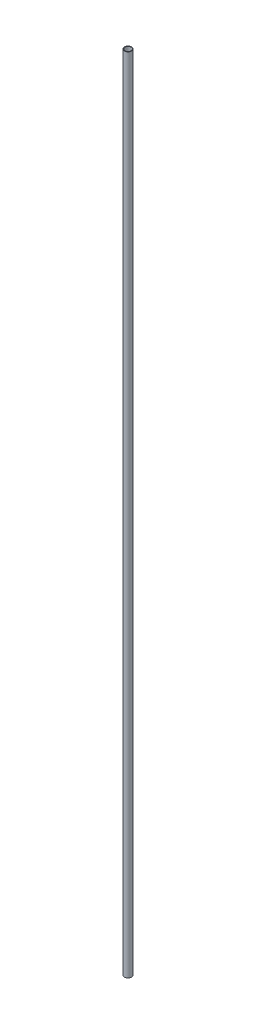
ISO-10303-21;
HEADER;
FILE_DESCRIPTION(('STEP AP214'),'2;1');
FILE_NAME('part.step','',(''),(''),'','','');
FILE_SCHEMA(('AUTOMOTIVE_DESIGN { 1 0 10303 214 1 1 1 1 }'));
ENDSEC;
DATA;
#1=APPLICATION_CONTEXT('core data for automotive mechanical design processes');
#2=APPLICATION_PROTOCOL_DEFINITION('international standard','automotive_design',2000,#1);
#3=PRODUCT_CONTEXT('',#1,'mechanical');
#4=PRODUCT('Part','Part','',(#3));
#5=PRODUCT_RELATED_PRODUCT_CATEGORY('part','',(#4));
#6=PRODUCT_DEFINITION_FORMATION('','',#4);
#7=PRODUCT_DEFINITION_CONTEXT('part definition',#1,'design');
#8=PRODUCT_DEFINITION('design','',#6,#7);
#9=PRODUCT_DEFINITION_SHAPE('','',#8);
#10=(LENGTH_UNIT() NAMED_UNIT(*) SI_UNIT(.MILLI.,.METRE.));
#11=(NAMED_UNIT(*) PLANE_ANGLE_UNIT() SI_UNIT($,.RADIAN.));
#12=(NAMED_UNIT(*) SI_UNIT($,.STERADIAN.) SOLID_ANGLE_UNIT());
#13=UNCERTAINTY_MEASURE_WITH_UNIT(LENGTH_MEASURE(1.E-05),#10,'distance_accuracy_value','');
#14=(GEOMETRIC_REPRESENTATION_CONTEXT(3) GLOBAL_UNCERTAINTY_ASSIGNED_CONTEXT((#13)) GLOBAL_UNIT_ASSIGNED_CONTEXT((#10,
#11,#12)) REPRESENTATION_CONTEXT('',''));
#15=CARTESIAN_POINT('',(0.,0.,0.));
#16=DIRECTION('',(0.,0.,1.));
#17=DIRECTION('',(1.,0.,0.));
#18=AXIS2_PLACEMENT_3D('',#15,#16,#17);
#19=CARTESIAN_POINT('',(0.,2108.2,0.));
#20=DIRECTION('',(0.,1.,0.));
#21=DIRECTION('',(0.,0.,1.));
#22=AXIS2_PLACEMENT_3D('',#19,#20,#21);
#23=PLANE('',#22);
#24=CARTESIAN_POINT('',(0.,2108.2,0.));
#25=DIRECTION('',(0.,1.,0.));
#26=DIRECTION('',(0.,0.,1.));
#27=AXIS2_PLACEMENT_3D('',#24,#25,#26);
#28=CIRCLE('',#27,9.525);
#29=CARTESIAN_POINT('',(0.,2108.2,9.525));
#30=VERTEX_POINT('',#29);
#31=EDGE_CURVE('E10',#30,#30,#28,.T.);
#32=ORIENTED_EDGE('',*,*,#31,.T.);
#33=EDGE_LOOP('',(#32));
#34=FACE_BOUND('',#33,.T.);
#35=CARTESIAN_POINT('',(0.,2108.2,0.));
#36=DIRECTION('',(0.,1.,0.));
#37=DIRECTION('',(0.,0.,1.));
#38=AXIS2_PLACEMENT_3D('',#35,#36,#37);
#39=CIRCLE('',#38,8.255);
#40=CARTESIAN_POINT('',(0.,2108.2,8.255));
#41=VERTEX_POINT('',#40);
#42=EDGE_CURVE('E50',#41,#41,#39,.T.);
#43=ORIENTED_EDGE('',*,*,#42,.F.);
#44=EDGE_LOOP('',(#43));
#45=FACE_BOUND('',#44,.T.);
#46=ADVANCED_FACE('F39',(#34,#45),#23,.T.);
#47=CARTESIAN_POINT('',(0.,0.,0.));
#48=DIRECTION('',(0.,1.,0.));
#49=DIRECTION('',(0.,0.,1.));
#50=AXIS2_PLACEMENT_3D('',#47,#48,#49);
#51=PLANE('',#50);
#52=CARTESIAN_POINT('',(0.,0.,0.));
#53=DIRECTION('',(0.,1.,0.));
#54=DIRECTION('',(0.,0.,1.));
#55=AXIS2_PLACEMENT_3D('',#52,#53,#54);
#56=CIRCLE('',#55,9.525);
#57=CARTESIAN_POINT('',(0.,0.,9.525));
#58=VERTEX_POINT('',#57);
#59=EDGE_CURVE('E43',#58,#58,#56,.T.);
#60=ORIENTED_EDGE('',*,*,#59,.F.);
#61=EDGE_LOOP('',(#60));
#62=FACE_BOUND('',#61,.T.);
#63=CARTESIAN_POINT('',(0.,0.,0.));
#64=DIRECTION('',(0.,1.,0.));
#65=DIRECTION('',(0.,0.,1.));
#66=AXIS2_PLACEMENT_3D('',#63,#64,#65);
#67=CIRCLE('',#66,8.255);
#68=CARTESIAN_POINT('',(0.,0.,8.255));
#69=VERTEX_POINT('',#68);
#70=EDGE_CURVE('E52',#69,#69,#67,.T.);
#71=ORIENTED_EDGE('',*,*,#70,.T.);
#72=EDGE_LOOP('',(#71));
#73=FACE_BOUND('',#72,.T.);
#74=ADVANCED_FACE('F62',(#62,#73),#51,.F.);
#75=CARTESIAN_POINT('',(0.,2108.2,0.));
#76=DIRECTION('',(0.,-1.,0.));
#77=DIRECTION('',(0.,0.,-1.));
#78=AXIS2_PLACEMENT_3D('',#75,#76,#77);
#79=CYLINDRICAL_SURFACE('',#78,9.525);
#80=ORIENTED_EDGE('',*,*,#31,.F.);
#81=EDGE_LOOP('',(#80));
#82=FACE_BOUND('',#81,.T.);
#83=ORIENTED_EDGE('',*,*,#59,.T.);
#84=EDGE_LOOP('',(#83));
#85=FACE_BOUND('',#84,.T.);
#86=ADVANCED_FACE('F41',(#82,#85),#79,.T.);
#87=CARTESIAN_POINT('',(0.,2108.2,0.));
#88=DIRECTION('',(0.,-1.,0.));
#89=DIRECTION('',(0.,0.,-1.));
#90=AXIS2_PLACEMENT_3D('',#87,#88,#89);
#91=CYLINDRICAL_SURFACE('',#90,8.255);
#92=ORIENTED_EDGE('',*,*,#42,.T.);
#93=EDGE_LOOP('',(#92));
#94=FACE_BOUND('',#93,.T.);
#95=ORIENTED_EDGE('',*,*,#70,.F.);
#96=EDGE_LOOP('',(#95));
#97=FACE_BOUND('',#96,.T.);
#98=ADVANCED_FACE('F58',(#94,#97),#91,.F.);
#99=CLOSED_SHELL('',(#46,#74,#86,#98));
#100=MANIFOLD_SOLID_BREP('B2',#99);
#101=ADVANCED_BREP_SHAPE_REPRESENTATION('',(#18,#100),#14);
#102=SHAPE_DEFINITION_REPRESENTATION(#9,#101);
ENDSEC;
END-ISO-10303-21;
